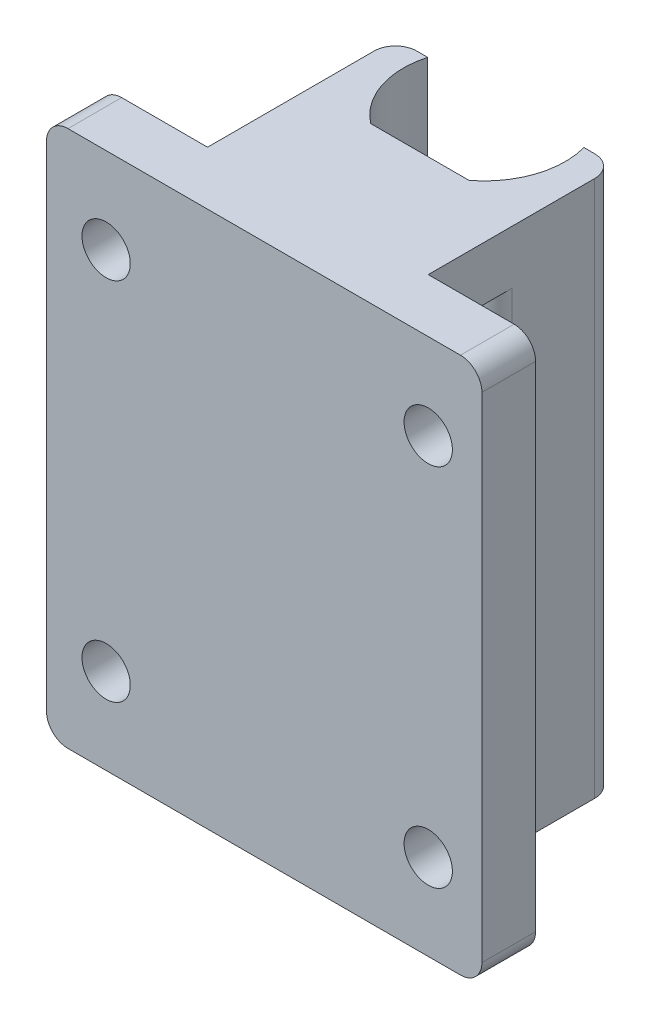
from build123d import *

# Parameters (mm, degrees)
BOSS_EXTRUDE1_DEPTH = 50
SKETCH2_W           = 14.553926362
SKETCH2_H           = 2.5
BOSS_EXTRUDE2_DEPTH = 10
FILLET1_R           = 2
SKETCH3_R           = 2.25
CUT_EXTRUDE1_DEPTH  = 64.645220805
SKETCH4_W           = 2
SKETCH4_H           = 5
CUT_EXTRUDE2_DEPTH  = 63.767765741
FILLET2_R           = 2


with BuildPart() as part:
    # Sketch1 → Boss-Extrude1 (new body)
    with BuildSketch(Plane(origin=(0, 0, 0), x_dir=(1, 0, 0), z_dir=(0, 1, 0))):
        with BuildLine():
            Line((-5.276963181, 0), (35.276963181, 0))
            Line((35.276963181, 0), (35.276963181, 5))
            Line((35.276963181, 5), (25.276963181, 5))
            Line((25.276963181, 5), (25.276963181, 22.5))
            Line((25.276963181, 22.5), (22.276963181, 22.5))
            ThreePointArc((22.276963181, 22.5), (15, 12.953199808), (7.723036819, 22.5))
            Line((7.723036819, 22.5), (4.723036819, 22.5))
            Line((4.723036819, 22.5), (4.723036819, 5))
            Line((4.723036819, 5), (-5.276963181, 5))
            Line((-5.276963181, 5), (-5.276963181, 0))
        make_face()
    extrude(amount=BOSS_EXTRUDE1_DEPTH)

    # Sketch2 → Boss-Extrude2 (add)
    with BuildSketch(Plane(origin=(0, 0, -14.5), x_dir=(-1, 0, 0), z_dir=(0, 0, -1))):
        with Locations((-15, 48.75)):
            Rectangle(SKETCH2_W, SKETCH2_H)
        with Locations((-15, 1.25)):
            Rectangle(SKETCH2_W, SKETCH2_H)
    extrude(amount=-BOSS_EXTRUDE2_DEPTH)

    # Fillet1
    fillet1_edges = [part.edges().sort_by_distance(p)[0] for p in [
        (35.276963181, 50, -2.5),
        (35.276963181, 0, -2.5),
        (-5.276963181, 0, -2.5),
        (4.723036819, 25, -22.5),
        (25.276963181, 25, -22.5),
        (-5.276963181, 50, -2.5),
    ]]
    fillet(fillet1_edges, radius=FILLET1_R)

    # Sketch3 → Cut-Extrude1 (cut, through all)
    with BuildSketch(Plane(origin=(0, 0, -5), x_dir=(-1, 0, 0), z_dir=(0, 0, -1))):
        with Locations((-30.276963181, 42)):
            Circle(SKETCH3_R)
        with Locations((-0.276963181, 42)):
            Circle(SKETCH3_R)
        with Locations((-0.276963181, 8)):
            Circle(SKETCH3_R)
        with Locations((-30.276963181, 8)):
            Circle(SKETCH3_R)
    extrude(amount=-CUT_EXTRUDE1_DEPTH, mode=Mode.SUBTRACT)

    # Sketch4 → Cut-Extrude2 (cut, through all)
    with BuildSketch(Plane.ZY.offset(-4.723036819)):
        with Locations((-9.802694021, 42.5)):
            Rectangle(SKETCH4_W, SKETCH4_H)
        with Locations((-9.802694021, 7.5)):
            Rectangle(SKETCH4_W, SKETCH4_H)
    extrude(amount=-CUT_EXTRUDE2_DEPTH, mode=Mode.SUBTRACT)

    # Fillet2
    fillet2_edges = [part.edges().sort_by_distance(p)[0] for p in [
        (25.276963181, 42.5, -10.802694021),
        (4.723036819, 42.5, -10.802694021),
        (25.276963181, 7.5, -10.802694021),
        (4.723036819, 7.5, -10.802694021),
    ]]
    fillet(fillet2_edges, radius=FILLET2_R)


solid = part.part
